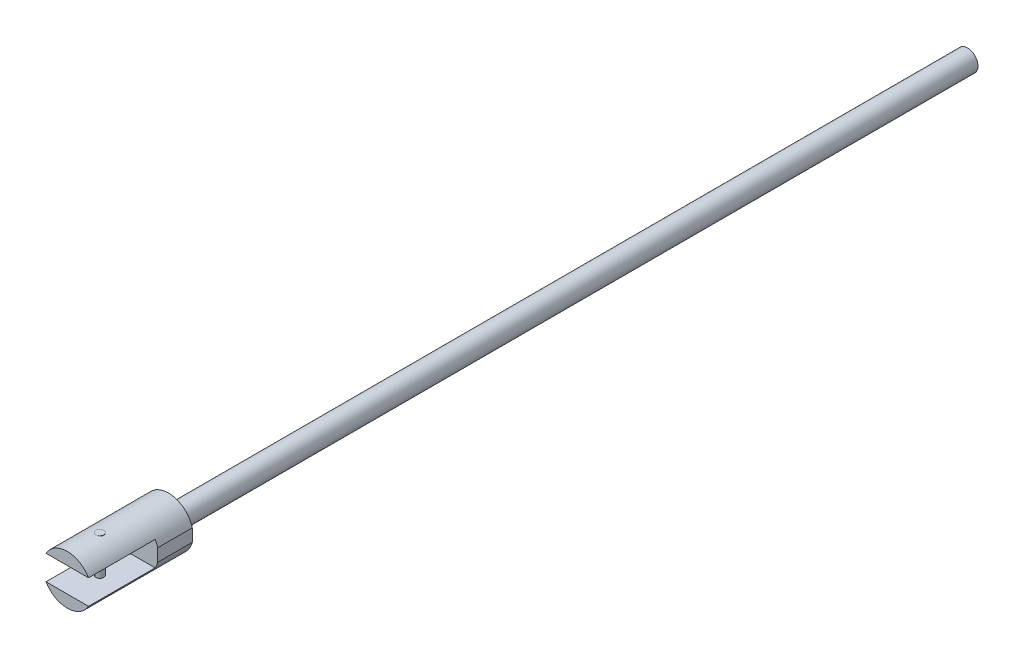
ISO-10303-21;
HEADER;
FILE_DESCRIPTION(('STEP AP214'),'2;1');
FILE_NAME('part.step','',(''),(''),'','','');
FILE_SCHEMA(('AUTOMOTIVE_DESIGN { 1 0 10303 214 1 1 1 1 }'));
ENDSEC;
DATA;
#1=APPLICATION_CONTEXT('core data for automotive mechanical design processes');
#2=APPLICATION_PROTOCOL_DEFINITION('international standard','automotive_design',2000,#1);
#3=PRODUCT_CONTEXT('',#1,'mechanical');
#4=PRODUCT('Part','Part','',(#3));
#5=PRODUCT_RELATED_PRODUCT_CATEGORY('part','',(#4));
#6=PRODUCT_DEFINITION_FORMATION('','',#4);
#7=PRODUCT_DEFINITION_CONTEXT('part definition',#1,'design');
#8=PRODUCT_DEFINITION('design','',#6,#7);
#9=PRODUCT_DEFINITION_SHAPE('','',#8);
#10=(LENGTH_UNIT() NAMED_UNIT(*) SI_UNIT(.MILLI.,.METRE.));
#11=(NAMED_UNIT(*) PLANE_ANGLE_UNIT() SI_UNIT($,.RADIAN.));
#12=(NAMED_UNIT(*) SI_UNIT($,.STERADIAN.) SOLID_ANGLE_UNIT());
#13=UNCERTAINTY_MEASURE_WITH_UNIT(LENGTH_MEASURE(1.E-05),#10,'distance_accuracy_value','');
#14=(GEOMETRIC_REPRESENTATION_CONTEXT(3) GLOBAL_UNCERTAINTY_ASSIGNED_CONTEXT((#13)) GLOBAL_UNIT_ASSIGNED_CONTEXT((#10,
#11,#12)) REPRESENTATION_CONTEXT('',''));
#15=CARTESIAN_POINT('',(0.,0.,0.));
#16=DIRECTION('',(0.,0.,1.));
#17=DIRECTION('',(1.,0.,0.));
#18=AXIS2_PLACEMENT_3D('',#15,#16,#17);
#19=CARTESIAN_POINT('',(-4.53418049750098,-4.68995455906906,159.004));
#20=DIRECTION('',(1.,0.,0.));
#21=DIRECTION('',(0.,0.,-1.));
#22=AXIS2_PLACEMENT_3D('',#19,#20,#21);
#23=PLANE('',#22);
#24=DIRECTION('',(0.,0.,1.));
#25=VECTOR('',#24,1.);
#26=CARTESIAN_POINT('',(-4.53418049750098,1.19869970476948,0.));
#27=LINE('',#26,#25);
#28=CARTESIAN_POINT('',(-4.53418049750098,1.19869970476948,152.4));
#29=VERTEX_POINT('',#28);
#30=CARTESIAN_POINT('',(-4.53418049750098,1.19869970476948,159.004));
#31=VERTEX_POINT('',#30);
#32=EDGE_CURVE('E154',#29,#31,#27,.T.);
#33=ORIENTED_EDGE('',*,*,#32,.F.);
#34=DIRECTION('',(0.,-1.,0.));
#35=VECTOR('',#34,1.);
#36=CARTESIAN_POINT('',(-4.53418049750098,-4.68995455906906,152.4));
#37=LINE('',#36,#35);
#38=CARTESIAN_POINT('',(-4.53418049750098,-1.19869970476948,152.4));
#39=VERTEX_POINT('',#38);
#40=EDGE_CURVE('E166',#29,#39,#37,.T.);
#41=ORIENTED_EDGE('',*,*,#40,.T.);
#42=DIRECTION('',(0.,0.,1.));
#43=VECTOR('',#42,1.);
#44=CARTESIAN_POINT('',(-4.53418049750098,-1.19869970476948,0.));
#45=LINE('',#44,#43);
#46=CARTESIAN_POINT('',(-4.53418049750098,-1.19869970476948,159.004));
#47=VERTEX_POINT('',#46);
#48=EDGE_CURVE('E144',#47,#39,#45,.F.);
#49=ORIENTED_EDGE('',*,*,#48,.F.);
#50=DIRECTION('',(0.,-1.,0.));
#51=VECTOR('',#50,1.);
#52=CARTESIAN_POINT('',(-4.53418049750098,-4.68995455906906,159.004));
#53=LINE('',#52,#51);
#54=EDGE_CURVE('E179',#31,#47,#53,.T.);
#55=ORIENTED_EDGE('',*,*,#54,.F.);
#56=EDGE_LOOP('',(#33,#41,#49,#55));
#57=FACE_BOUND('',#56,.T.);
#58=ADVANCED_FACE('F36',(#57),#23,.F.);
#59=CARTESIAN_POINT('',(4.53418049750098,-4.68995455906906,159.004));
#60=DIRECTION('',(-1.,0.,0.));
#61=DIRECTION('',(0.,0.,1.));
#62=AXIS2_PLACEMENT_3D('',#59,#60,#61);
#63=PLANE('',#62);
#64=DIRECTION('',(0.,0.,1.));
#65=VECTOR('',#64,1.);
#66=CARTESIAN_POINT('',(4.53418049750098,-1.19869970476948,0.));
#67=LINE('',#66,#65);
#68=CARTESIAN_POINT('',(4.53418049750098,-1.19869970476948,152.4));
#69=VERTEX_POINT('',#68);
#70=CARTESIAN_POINT('',(4.53418049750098,-1.19869970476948,159.004));
#71=VERTEX_POINT('',#70);
#72=EDGE_CURVE('E136',#69,#71,#67,.T.);
#73=ORIENTED_EDGE('',*,*,#72,.F.);
#74=DIRECTION('',(0.,1.,0.));
#75=VECTOR('',#74,1.);
#76=CARTESIAN_POINT('',(4.53418049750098,-4.68995455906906,152.4));
#77=LINE('',#76,#75);
#78=CARTESIAN_POINT('',(4.53418049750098,1.19869970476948,152.4));
#79=VERTEX_POINT('',#78);
#80=EDGE_CURVE('E184',#69,#79,#77,.T.);
#81=ORIENTED_EDGE('',*,*,#80,.T.);
#82=DIRECTION('',(0.,0.,1.));
#83=VECTOR('',#82,1.);
#84=CARTESIAN_POINT('',(4.53418049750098,1.19869970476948,0.));
#85=LINE('',#84,#83);
#86=CARTESIAN_POINT('',(4.53418049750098,1.19869970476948,159.004));
#87=VERTEX_POINT('',#86);
#88=EDGE_CURVE('E143',#87,#79,#85,.F.);
#89=ORIENTED_EDGE('',*,*,#88,.F.);
#90=DIRECTION('',(0.,1.,0.));
#91=VECTOR('',#90,1.);
#92=CARTESIAN_POINT('',(4.53418049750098,-4.68995455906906,159.004));
#93=LINE('',#92,#91);
#94=EDGE_CURVE('E176',#71,#87,#93,.T.);
#95=ORIENTED_EDGE('',*,*,#94,.F.);
#96=EDGE_LOOP('',(#73,#81,#89,#95));
#97=FACE_BOUND('',#96,.T.);
#98=ADVANCED_FACE('F205',(#97),#63,.F.);
#99=CARTESIAN_POINT('',(0.,0.,159.004));
#100=DIRECTION('',(0.,0.,1.));
#101=DIRECTION('',(1.,0.,0.));
#102=AXIS2_PLACEMENT_3D('',#99,#100,#101);
#103=PLANE('',#102);
#104=ORIENTED_EDGE('',*,*,#94,.T.);
#105=CARTESIAN_POINT('',(0.,0.,159.004));
#106=DIRECTION('',(0.,0.,1.));
#107=DIRECTION('',(1.,0.,0.));
#108=AXIS2_PLACEMENT_3D('',#105,#106,#107);
#109=CIRCLE('',#108,4.68995455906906);
#110=CARTESIAN_POINT('',(4.05807772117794,2.35110165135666,159.004));
#111=VERTEX_POINT('',#110);
#112=EDGE_CURVE('E151',#87,#111,#109,.T.);
#113=ORIENTED_EDGE('',*,*,#112,.T.);
#114=DIRECTION('',(1.,0.,0.));
#115=VECTOR('',#114,1.);
#116=CARTESIAN_POINT('',(-4.53418049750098,2.35110165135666,159.004));
#117=LINE('',#116,#115);
#118=CARTESIAN_POINT('',(-4.05807772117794,2.35110165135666,159.004));
#119=VERTEX_POINT('',#118);
#120=EDGE_CURVE('E160',#119,#111,#117,.T.);
#121=ORIENTED_EDGE('',*,*,#120,.F.);
#122=EDGE_CURVE('E137',#119,#31,#109,.T.);
#123=ORIENTED_EDGE('',*,*,#122,.T.);
#124=ORIENTED_EDGE('',*,*,#54,.T.);
#125=CARTESIAN_POINT('',(-4.05807772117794,-2.35110165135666,159.004));
#126=VERTEX_POINT('',#125);
#127=EDGE_CURVE('E138',#47,#126,#109,.T.);
#128=ORIENTED_EDGE('',*,*,#127,.T.);
#129=DIRECTION('',(1.,0.,0.));
#130=VECTOR('',#129,1.);
#131=CARTESIAN_POINT('',(-4.53418049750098,-2.35110165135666,159.004));
#132=LINE('',#131,#130);
#133=CARTESIAN_POINT('',(4.05807772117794,-2.35110165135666,159.004));
#134=VERTEX_POINT('',#133);
#135=EDGE_CURVE('E156',#126,#134,#132,.T.);
#136=ORIENTED_EDGE('',*,*,#135,.T.);
#137=EDGE_CURVE('E133',#134,#71,#109,.T.);
#138=ORIENTED_EDGE('',*,*,#137,.T.);
#139=EDGE_LOOP('',(#104,#113,#121,#123,#124,#128,#136,#138));
#140=FACE_BOUND('',#139,.T.);
#141=ADVANCED_FACE('F210',(#140),#103,.T.);
#142=CARTESIAN_POINT('',(0.,0.,152.4));
#143=DIRECTION('',(0.,0.,1.));
#144=DIRECTION('',(1.,0.,0.));
#145=AXIS2_PLACEMENT_3D('',#142,#143,#144);
#146=PLANE('',#145);
#147=CARTESIAN_POINT('',(0.,0.,152.4));
#148=DIRECTION('',(0.,0.,1.));
#149=DIRECTION('',(1.,0.,0.));
#150=AXIS2_PLACEMENT_3D('',#147,#148,#149);
#151=CIRCLE('',#150,2.);
#152=CARTESIAN_POINT('',(-2.,0.,152.4));
#153=VERTEX_POINT('',#152);
#154=EDGE_CURVE('E187',#153,#153,#151,.T.);
#155=ORIENTED_EDGE('',*,*,#154,.T.);
#156=EDGE_LOOP('',(#155));
#157=FACE_BOUND('',#156,.T.);
#158=CARTESIAN_POINT('',(0.,0.,152.4));
#159=DIRECTION('',(0.,0.,1.));
#160=DIRECTION('',(1.,0.,0.));
#161=AXIS2_PLACEMENT_3D('',#158,#159,#160);
#162=CIRCLE('',#161,4.68995455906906);
#163=EDGE_CURVE('E141',#79,#29,#162,.T.);
#164=ORIENTED_EDGE('',*,*,#163,.F.);
#165=ORIENTED_EDGE('',*,*,#80,.F.);
#166=EDGE_CURVE('E140',#39,#69,#162,.T.);
#167=ORIENTED_EDGE('',*,*,#166,.F.);
#168=ORIENTED_EDGE('',*,*,#40,.F.);
#169=EDGE_LOOP('',(#164,#165,#167,#168));
#170=FACE_BOUND('',#169,.T.);
#171=ADVANCED_FACE('F215',(#157,#170),#146,.F.);
#172=CARTESIAN_POINT('',(-4.53418049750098,2.35110165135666,171.704));
#173=DIRECTION('',(0.,1.,0.));
#174=DIRECTION('',(0.,0.,1.));
#175=AXIS2_PLACEMENT_3D('',#172,#173,#174);
#176=PLANE('',#175);
#177=CARTESIAN_POINT('',(0.,2.35110165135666,165.48700250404));
#178=DIRECTION('',(0.,1.,0.));
#179=DIRECTION('',(0.,0.,1.));
#180=AXIS2_PLACEMENT_3D('',#177,#178,#179);
#181=CIRCLE('',#180,0.75);
#182=CARTESIAN_POINT('',(0.,2.35110165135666,166.23700250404));
#183=VERTEX_POINT('',#182);
#184=EDGE_CURVE('E124',#183,#183,#181,.T.);
#185=ORIENTED_EDGE('',*,*,#184,.T.);
#186=EDGE_LOOP('',(#185));
#187=FACE_BOUND('',#186,.T.);
#188=DIRECTION('',(0.,0.,1.));
#189=VECTOR('',#188,1.);
#190=CARTESIAN_POINT('',(-4.05807772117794,2.35110165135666,0.));
#191=LINE('',#190,#189);
#192=CARTESIAN_POINT('',(-4.05807772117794,2.35110165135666,171.704));
#193=VERTEX_POINT('',#192);
#194=EDGE_CURVE('E63',#119,#193,#191,.T.);
#195=ORIENTED_EDGE('',*,*,#194,.F.);
#196=ORIENTED_EDGE('',*,*,#120,.T.);
#197=DIRECTION('',(0.,0.,1.));
#198=VECTOR('',#197,1.);
#199=CARTESIAN_POINT('',(4.05807772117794,2.35110165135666,0.));
#200=LINE('',#199,#198);
#201=CARTESIAN_POINT('',(4.05807772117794,2.35110165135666,171.704));
#202=VERTEX_POINT('',#201);
#203=EDGE_CURVE('E149',#202,#111,#200,.F.);
#204=ORIENTED_EDGE('',*,*,#203,.F.);
#205=DIRECTION('',(1.,0.,0.));
#206=VECTOR('',#205,1.);
#207=CARTESIAN_POINT('',(-4.53418049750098,2.35110165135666,171.704));
#208=LINE('',#207,#206);
#209=EDGE_CURVE('E163',#193,#202,#208,.T.);
#210=ORIENTED_EDGE('',*,*,#209,.F.);
#211=EDGE_LOOP('',(#195,#196,#204,#210));
#212=FACE_BOUND('',#211,.T.);
#213=ADVANCED_FACE('F218',(#187,#212),#176,.F.);
#214=CARTESIAN_POINT('',(0.,0.,171.704));
#215=DIRECTION('',(0.,0.,1.));
#216=DIRECTION('',(1.,0.,0.));
#217=AXIS2_PLACEMENT_3D('',#214,#215,#216);
#218=PLANE('',#217);
#219=ORIENTED_EDGE('',*,*,#209,.T.);
#220=CARTESIAN_POINT('',(0.,0.,171.704));
#221=DIRECTION('',(0.,0.,1.));
#222=DIRECTION('',(1.,0.,0.));
#223=AXIS2_PLACEMENT_3D('',#220,#221,#222);
#224=CIRCLE('',#223,4.68995455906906);
#225=EDGE_CURVE('E126',#202,#193,#224,.T.);
#226=ORIENTED_EDGE('',*,*,#225,.T.);
#227=EDGE_LOOP('',(#219,#226));
#228=FACE_BOUND('',#227,.T.);
#229=ADVANCED_FACE('F225',(#228),#218,.T.);
#230=CARTESIAN_POINT('',(-4.53418049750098,-2.35110165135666,171.704));
#231=DIRECTION('',(0.,1.,0.));
#232=DIRECTION('',(0.,0.,1.));
#233=AXIS2_PLACEMENT_3D('',#230,#231,#232);
#234=PLANE('',#233);
#235=CARTESIAN_POINT('',(0.,-2.35110165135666,165.48700250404));
#236=DIRECTION('',(0.,1.,0.));
#237=DIRECTION('',(0.,0.,1.));
#238=AXIS2_PLACEMENT_3D('',#235,#236,#237);
#239=CIRCLE('',#238,0.75);
#240=CARTESIAN_POINT('',(0.,-2.35110165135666,166.23700250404));
#241=VERTEX_POINT('',#240);
#242=EDGE_CURVE('E12',#241,#241,#239,.T.);
#243=ORIENTED_EDGE('',*,*,#242,.F.);
#244=EDGE_LOOP('',(#243));
#245=FACE_BOUND('',#244,.T.);
#246=ORIENTED_EDGE('',*,*,#135,.F.);
#247=DIRECTION('',(0.,0.,1.));
#248=VECTOR('',#247,1.);
#249=CARTESIAN_POINT('',(-4.05807772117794,-2.35110165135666,0.));
#250=LINE('',#249,#248);
#251=CARTESIAN_POINT('',(-4.05807772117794,-2.35110165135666,171.704));
#252=VERTEX_POINT('',#251);
#253=EDGE_CURVE('E146',#126,#252,#250,.T.);
#254=ORIENTED_EDGE('',*,*,#253,.T.);
#255=DIRECTION('',(1.,0.,0.));
#256=VECTOR('',#255,1.);
#257=CARTESIAN_POINT('',(-4.53418049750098,-2.35110165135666,171.704));
#258=LINE('',#257,#256);
#259=CARTESIAN_POINT('',(4.05807772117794,-2.35110165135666,171.704));
#260=VERTEX_POINT('',#259);
#261=EDGE_CURVE('E157',#252,#260,#258,.T.);
#262=ORIENTED_EDGE('',*,*,#261,.T.);
#263=DIRECTION('',(0.,0.,1.));
#264=VECTOR('',#263,1.);
#265=CARTESIAN_POINT('',(4.05807772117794,-2.35110165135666,0.));
#266=LINE('',#265,#264);
#267=EDGE_CURVE('E130',#260,#134,#266,.F.);
#268=ORIENTED_EDGE('',*,*,#267,.T.);
#269=EDGE_LOOP('',(#246,#254,#262,#268));
#270=FACE_BOUND('',#269,.T.);
#271=ADVANCED_FACE('F229',(#245,#270),#234,.T.);
#272=CARTESIAN_POINT('',(0.,0.,171.704));
#273=DIRECTION('',(0.,0.,1.));
#274=DIRECTION('',(1.,0.,0.));
#275=AXIS2_PLACEMENT_3D('',#272,#273,#274);
#276=PLANE('',#275);
#277=ORIENTED_EDGE('',*,*,#261,.F.);
#278=CARTESIAN_POINT('',(0.,0.,171.704));
#279=DIRECTION('',(0.,0.,1.));
#280=DIRECTION('',(1.,0.,0.));
#281=AXIS2_PLACEMENT_3D('',#278,#279,#280);
#282=CIRCLE('',#281,4.68995455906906);
#283=EDGE_CURVE('E118',#252,#260,#282,.T.);
#284=ORIENTED_EDGE('',*,*,#283,.T.);
#285=EDGE_LOOP('',(#277,#284));
#286=FACE_BOUND('',#285,.T.);
#287=ADVANCED_FACE('F201',(#286),#276,.T.);
#288=CARTESIAN_POINT('',(0.,0.,152.4));
#289=DIRECTION('',(0.,0.,-1.));
#290=DIRECTION('',(-1.,0.,0.));
#291=AXIS2_PLACEMENT_3D('',#288,#289,#290);
#292=CYLINDRICAL_SURFACE('',#291,2.);
#293=CARTESIAN_POINT('',(0.,0.,0.));
#294=DIRECTION('',(0.,0.,1.));
#295=DIRECTION('',(1.,0.,0.));
#296=AXIS2_PLACEMENT_3D('',#293,#294,#295);
#297=CIRCLE('',#296,2.);
#298=CARTESIAN_POINT('',(-2.,0.,0.));
#299=VERTEX_POINT('',#298);
#300=EDGE_CURVE('E178',#299,#299,#297,.T.);
#301=CARTESIAN_POINT('',(-2.,0.,152.4));
#302=CARTESIAN_POINT('',(-2.,0.,150.8125));
#303=CARTESIAN_POINT('',(-2.,0.,149.225));
#304=CARTESIAN_POINT('',(-2.,0.,146.05));
#305=CARTESIAN_POINT('',(-2.,0.,144.4625));
#306=CARTESIAN_POINT('',(-2.,0.,141.2875));
#307=CARTESIAN_POINT('',(-2.,0.,139.7));
#308=CARTESIAN_POINT('',(-2.,0.,136.525));
#309=CARTESIAN_POINT('',(-2.,0.,134.9375));
#310=CARTESIAN_POINT('',(-2.,0.,131.7625));
#311=CARTESIAN_POINT('',(-2.,0.,130.175));
#312=CARTESIAN_POINT('',(-2.,0.,127.));
#313=CARTESIAN_POINT('',(-2.,0.,125.4125));
#314=CARTESIAN_POINT('',(-2.,0.,122.2375));
#315=CARTESIAN_POINT('',(-2.,0.,120.65));
#316=CARTESIAN_POINT('',(-2.,0.,117.475));
#317=CARTESIAN_POINT('',(-2.,0.,115.8875));
#318=CARTESIAN_POINT('',(-2.,0.,112.7125));
#319=CARTESIAN_POINT('',(-2.,0.,111.125));
#320=CARTESIAN_POINT('',(-2.,0.,107.95));
#321=CARTESIAN_POINT('',(-2.,0.,106.3625));
#322=CARTESIAN_POINT('',(-2.,0.,103.1875));
#323=CARTESIAN_POINT('',(-2.,0.,101.6));
#324=CARTESIAN_POINT('',(-2.,0.,98.425));
#325=CARTESIAN_POINT('',(-2.,0.,96.8375));
#326=CARTESIAN_POINT('',(-2.,0.,93.6625));
#327=CARTESIAN_POINT('',(-2.,0.,92.075));
#328=CARTESIAN_POINT('',(-2.,0.,88.9));
#329=CARTESIAN_POINT('',(-2.,0.,87.3125));
#330=CARTESIAN_POINT('',(-2.,0.,84.1375));
#331=CARTESIAN_POINT('',(-2.,0.,82.55));
#332=CARTESIAN_POINT('',(-2.,0.,79.375));
#333=CARTESIAN_POINT('',(-2.,0.,77.7875));
#334=CARTESIAN_POINT('',(-2.,0.,74.6125));
#335=CARTESIAN_POINT('',(-2.,0.,73.025));
#336=CARTESIAN_POINT('',(-2.,0.,69.85));
#337=CARTESIAN_POINT('',(-2.,0.,68.2625));
#338=CARTESIAN_POINT('',(-2.,0.,65.0875));
#339=CARTESIAN_POINT('',(-2.,0.,63.5));
#340=CARTESIAN_POINT('',(-2.,0.,60.325));
#341=CARTESIAN_POINT('',(-2.,0.,58.7375));
#342=CARTESIAN_POINT('',(-2.,0.,55.5625));
#343=CARTESIAN_POINT('',(-2.,0.,53.975));
#344=CARTESIAN_POINT('',(-2.,0.,50.8));
#345=CARTESIAN_POINT('',(-2.,0.,49.2125));
#346=CARTESIAN_POINT('',(-2.,0.,46.0375));
#347=CARTESIAN_POINT('',(-2.,0.,44.45));
#348=CARTESIAN_POINT('',(-2.,0.,41.275));
#349=CARTESIAN_POINT('',(-2.,0.,39.6875));
#350=CARTESIAN_POINT('',(-2.,0.,36.5125));
#351=CARTESIAN_POINT('',(-2.,0.,34.925));
#352=CARTESIAN_POINT('',(-2.,0.,31.75));
#353=CARTESIAN_POINT('',(-2.,0.,30.1625));
#354=CARTESIAN_POINT('',(-2.,0.,26.9875));
#355=CARTESIAN_POINT('',(-2.,0.,25.4));
#356=CARTESIAN_POINT('',(-2.,0.,22.225));
#357=CARTESIAN_POINT('',(-2.,0.,20.6375));
#358=CARTESIAN_POINT('',(-2.,0.,17.4625));
#359=CARTESIAN_POINT('',(-2.,0.,15.875));
#360=CARTESIAN_POINT('',(-2.,0.,12.7));
#361=CARTESIAN_POINT('',(-2.,0.,11.1125));
#362=CARTESIAN_POINT('',(-2.,0.,7.93750000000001));
#363=CARTESIAN_POINT('',(-2.,0.,6.35));
#364=CARTESIAN_POINT('',(-2.,0.,3.175));
#365=CARTESIAN_POINT('',(-2.,0.,1.5875));
#366=CARTESIAN_POINT('',(-2.,0.,0.));
#367=B_SPLINE_CURVE_WITH_KNOTS('',3,(#301,#302,#303,#304,#305,#306,#307,#308,#309,#310,#311,
#312,#313,#314,#315,#316,#317,#318,#319,#320,#321,#322,#323,#324,#325,#326,#327,#328,#329,#330,
#331,#332,#333,#334,#335,#336,#337,#338,#339,#340,#341,#342,#343,#344,#345,#346,#347,#348,#349,
#350,#351,#352,#353,#354,#355,#356,#357,#358,#359,#360,#361,#362,#363,#364,#365,#366),
.UNSPECIFIED.,.F.,.F.,(4,2,2,2,2,2,2,2,2,2,2,2,2,2,2,2,2,2,2,2,2,2,2,2,2,2,2,2,2,2,2,2,4),(0.,
4.7625,9.52500000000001,14.2875,19.05,23.8125,28.575,33.3375,38.1,42.8625,47.625,52.3875,57.15,
61.9125,66.675,71.4375,76.2,80.9625,85.725,90.4875,95.25,100.0125,104.775,109.5375,114.3,
119.0625,123.825,128.5875,133.35,138.1125,142.875,147.6375,152.4),.UNSPECIFIED.);
#368=EDGE_CURVE('BSEAM38',#153,#299,#367,.T.);
#369=ORIENTED_EDGE('',*,*,#154,.F.);
#370=ORIENTED_EDGE('',*,*,#300,.T.);
#371=ORIENTED_EDGE('',*,*,#368,.T.);
#372=ORIENTED_EDGE('',*,*,#368,.F.);
#373=EDGE_LOOP('',(#369,#371,#370,#372));
#374=FACE_BOUND('',#373,.T.);
#375=ADVANCED_FACE('F38',(#374),#292,.T.);
#376=CARTESIAN_POINT('',(0.,0.,0.));
#377=DIRECTION('',(0.,0.,1.));
#378=DIRECTION('',(1.,0.,0.));
#379=AXIS2_PLACEMENT_3D('',#376,#377,#378);
#380=PLANE('',#379);
#381=ORIENTED_EDGE('',*,*,#300,.F.);
#382=EDGE_LOOP('',(#381));
#383=FACE_BOUND('',#382,.T.);
#384=ADVANCED_FACE('F193',(#383),#380,.F.);
#385=CARTESIAN_POINT('',(0.,0.,0.));
#386=DIRECTION('',(0.,0.,1.));
#387=DIRECTION('',(1.,0.,0.));
#388=AXIS2_PLACEMENT_3D('',#385,#386,#387);
#389=CYLINDRICAL_SURFACE('',#388,4.68995455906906);
#390=ORIENTED_EDGE('',*,*,#166,.T.);
#391=ORIENTED_EDGE('',*,*,#72,.T.);
#392=ORIENTED_EDGE('',*,*,#137,.F.);
#393=ORIENTED_EDGE('',*,*,#267,.F.);
#394=ORIENTED_EDGE('',*,*,#283,.F.);
#395=ORIENTED_EDGE('',*,*,#253,.F.);
#396=ORIENTED_EDGE('',*,*,#127,.F.);
#397=ORIENTED_EDGE('',*,*,#48,.T.);
#398=EDGE_LOOP('',(#390,#391,#392,#393,#394,#395,#396,#397));
#399=FACE_BOUND('',#398,.T.);
#400=ADVANCED_FACE('F195',(#399),#389,.T.);
#401=CARTESIAN_POINT('',(0.,4.68995455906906,166.23700250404));
#402=CARTESIAN_POINT('',(0.0418416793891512,4.68995385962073,166.237000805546));
#403=CARTESIAN_POINT('',(0.0837067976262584,4.68938877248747,166.233489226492));
#404=CARTESIAN_POINT('',(0.166264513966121,4.68718893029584,166.2195405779));
#405=CARTESIAN_POINT('',(0.206955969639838,4.68555316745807,166.209096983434));
#406=CARTESIAN_POINT('',(0.28595983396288,4.68139559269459,166.181606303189));
#407=CARTESIAN_POINT('',(0.324274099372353,4.67887448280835,166.164564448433));
#408=CARTESIAN_POINT('',(0.397493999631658,4.67322399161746,166.124374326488));
#409=CARTESIAN_POINT('',(0.432400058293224,4.67009468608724,166.101226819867));
#410=CARTESIAN_POINT('',(0.498126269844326,4.6635442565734,166.049264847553));
#411=CARTESIAN_POINT('',(0.528911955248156,4.66012102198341,166.020407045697));
#412=CARTESIAN_POINT('',(0.585225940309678,4.65338486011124,165.957936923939));
#413=CARTESIAN_POINT('',(0.610753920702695,4.65007193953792,165.92432431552));
#414=CARTESIAN_POINT('',(0.655964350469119,4.64391105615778,165.853064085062));
#415=CARTESIAN_POINT('',(0.675613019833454,4.64106582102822,165.81539477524));
#416=CARTESIAN_POINT('',(0.708291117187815,4.63619155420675,165.737237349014));
#417=CARTESIAN_POINT('',(0.721320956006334,4.63416247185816,165.696749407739));
#418=CARTESIAN_POINT('',(0.740283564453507,4.63117115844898,165.614468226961));
#419=CARTESIAN_POINT('',(0.746275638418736,4.6302000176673,165.572688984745));
#420=CARTESIAN_POINT('',(0.75117643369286,4.62940755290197,165.488707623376));
#421=CARTESIAN_POINT('',(0.75008561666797,4.62958615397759,165.446505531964));
#422=CARTESIAN_POINT('',(0.740899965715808,4.63106485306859,165.363297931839));
#423=CARTESIAN_POINT('',(0.732871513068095,4.6323543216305,165.322284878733));
#424=CARTESIAN_POINT('',(0.710142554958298,4.63589284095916,165.242195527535));
#425=CARTESIAN_POINT('',(0.695441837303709,4.63814192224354,165.203119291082));
#426=CARTESIAN_POINT('',(0.659717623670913,4.64335784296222,165.127812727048));
#427=CARTESIAN_POINT('',(0.638666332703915,4.64632782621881,165.091595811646));
#428=CARTESIAN_POINT('',(0.590858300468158,4.65264868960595,165.023183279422));
#429=CARTESIAN_POINT('',(0.564101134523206,4.65599959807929,164.990987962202));
#430=CARTESIAN_POINT('',(0.505278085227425,4.66275156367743,164.931148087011));
#431=CARTESIAN_POINT('',(0.473155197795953,4.66615275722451,164.903559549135));
#432=CARTESIAN_POINT('',(0.404705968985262,4.67258671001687,164.854156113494));
#433=CARTESIAN_POINT('',(0.368379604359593,4.67561946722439,164.832341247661));
#434=CARTESIAN_POINT('',(0.292503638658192,4.68097865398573,164.795100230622));
#435=CARTESIAN_POINT('',(0.252951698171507,4.68330456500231,164.779678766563));
#436=CARTESIAN_POINT('',(0.171773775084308,4.68698376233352,164.75571292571));
#437=CARTESIAN_POINT('',(0.130147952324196,4.68833712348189,164.747168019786));
#438=CARTESIAN_POINT('',(0.0464869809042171,4.68990873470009,164.737273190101));
#439=CARTESIAN_POINT('',(0.00446115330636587,4.69013912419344,164.735846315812));
#440=CARTESIAN_POINT('',(-0.079229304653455,4.68947199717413,164.740023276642));
#441=CARTESIAN_POINT('',(-0.120893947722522,4.68857452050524,164.745626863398));
#442=CARTESIAN_POINT('',(-0.202443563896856,4.68576001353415,164.763641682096));
#443=CARTESIAN_POINT('',(-0.242337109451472,4.68384865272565,164.776015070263));
#444=CARTESIAN_POINT('',(-0.319483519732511,4.67921989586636,164.807178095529));
#445=CARTESIAN_POINT('',(-0.356736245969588,4.6765024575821,164.825968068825));
#446=CARTESIAN_POINT('',(-0.42787952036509,4.67053307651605,164.869608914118));
#447=CARTESIAN_POINT('',(-0.461740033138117,4.6672769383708,164.894508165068));
#448=CARTESIAN_POINT('',(-0.524829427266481,4.66060469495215,164.949593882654));
#449=CARTESIAN_POINT('',(-0.554058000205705,4.65718857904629,164.979780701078));
#450=CARTESIAN_POINT('',(-0.607336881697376,4.6505424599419,165.044928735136));
#451=CARTESIAN_POINT('',(-0.631335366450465,4.64731453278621,165.07993257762));
#452=CARTESIAN_POINT('',(-0.673111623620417,4.64144820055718,165.153519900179));
#453=CARTESIAN_POINT('',(-0.690889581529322,4.63880977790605,165.19210327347));
#454=CARTESIAN_POINT('',(-0.719641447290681,4.63443654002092,165.271605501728));
#455=CARTESIAN_POINT('',(-0.730641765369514,4.63269822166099,165.312514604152));
#456=CARTESIAN_POINT('',(-0.745609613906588,4.6303130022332,165.395629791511));
#457=CARTESIAN_POINT('',(-0.749577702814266,4.62966601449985,165.437835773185));
#458=CARTESIAN_POINT('',(-0.75035383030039,4.62954024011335,165.521829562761));
#459=CARTESIAN_POINT('',(-0.747243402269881,4.6300481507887,165.563616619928));
#460=CARTESIAN_POINT('',(-0.73412643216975,4.63214589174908,165.64606489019));
#461=CARTESIAN_POINT('',(-0.724119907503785,4.63373571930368,165.686726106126));
#462=CARTESIAN_POINT('',(-0.697525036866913,4.63781327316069,165.765740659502));
#463=CARTESIAN_POINT('',(-0.680943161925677,4.64030011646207,165.804096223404));
#464=CARTESIAN_POINT('',(-0.641676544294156,4.64589243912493,165.877494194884));
#465=CARTESIAN_POINT('',(-0.618991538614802,4.6489979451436,165.912536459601));
#466=CARTESIAN_POINT('',(-0.567869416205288,4.65552010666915,165.978726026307));
#467=CARTESIAN_POINT('',(-0.539372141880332,4.65893979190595,166.009826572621));
#468=CARTESIAN_POINT('',(-0.477561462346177,4.66568036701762,166.066832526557));
#469=CARTESIAN_POINT('',(-0.444246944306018,4.66900123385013,166.092736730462));
#470=CARTESIAN_POINT('',(-0.373498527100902,4.67519415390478,166.138762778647));
#471=CARTESIAN_POINT('',(-0.336039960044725,4.6780632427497,166.158847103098));
#472=CARTESIAN_POINT('',(-0.258251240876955,4.68300042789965,166.192408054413));
#473=CARTESIAN_POINT('',(-0.21792404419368,4.68506933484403,166.205891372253));
#474=CARTESIAN_POINT('',(-0.147858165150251,4.68771285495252,166.222885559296));
#475=CARTESIAN_POINT('',(-0.118547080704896,4.68854907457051,166.228171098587));
#476=CARTESIAN_POINT('',(-0.0594946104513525,4.68967017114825,166.235230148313));
#477=CARTESIAN_POINT('',(-0.0297532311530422,4.6899550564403,166.237003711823));
#478=CARTESIAN_POINT('',(0.,4.68995455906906,166.23700250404));
#479=B_SPLINE_CURVE_WITH_KNOTS('',3,(#401,#402,#403,#404,#405,#406,#407,#408,#409,#410,#411,
#412,#413,#414,#415,#416,#417,#418,#419,#420,#421,#422,#423,#424,#425,#426,#427,#428,#429,#430,
#431,#432,#433,#434,#435,#436,#437,#438,#439,#440,#441,#442,#443,#444,#445,#446,#447,#448,#449,
#450,#451,#452,#453,#454,#455,#456,#457,#458,#459,#460,#461,#462,#463,#464,#465,#466,#467,#468,
#469,#470,#471,#472,#473,#474,#475,#476,#477,#478),.UNSPECIFIED.,.T.,.F.,(4,2,2,2,2,2,2,2,2,2,2,
2,2,2,2,2,2,2,2,2,2,2,2,2,2,2,2,2,2,2,2,2,2,2,2,2,2,2,4),(0.,0.125416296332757,0.25095081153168,
0.376386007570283,0.501805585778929,0.628216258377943,0.754634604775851,0.881765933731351,
1.00888937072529,1.13493372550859,1.26096986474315,1.38581324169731,1.51066058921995,
1.63606249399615,1.76147373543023,1.88831365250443,2.01515427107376,2.14208771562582,
2.26901139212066,2.3945599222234,2.52010401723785,2.64495337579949,2.76980927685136,
2.89568775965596,3.02157462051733,3.14865723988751,3.27573606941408,3.40231653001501,
3.52888693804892,3.65400684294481,3.77912643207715,3.9041231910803,4.02912533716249,
4.1554936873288,4.28189127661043,4.40908647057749,4.53615246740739,4.62533618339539,
4.71451855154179),.UNSPECIFIED.);
#480=CARTESIAN_POINT('',(0.,4.68995455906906,166.23700250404));
#481=VERTEX_POINT('',#480);
#482=CARTESIAN_POINT('',(1.55795797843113E-12,4.68995455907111,164.737002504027));
#483=VERTEX_POINT('',#482);
#484=EDGE_CURVE('E49',#481,#483,#479,.T.);
#485=ORIENTED_EDGE('',*,*,#484,.F.);
#486=EDGE_CURVE('E40',#483,#481,#479,.T.);
#487=ORIENTED_EDGE('',*,*,#486,.F.);
#488=EDGE_LOOP('',(#485,#487));
#489=FACE_BOUND('',#488,.T.);
#490=ORIENTED_EDGE('',*,*,#163,.T.);
#491=ORIENTED_EDGE('',*,*,#32,.T.);
#492=ORIENTED_EDGE('',*,*,#122,.F.);
#493=ORIENTED_EDGE('',*,*,#194,.T.);
#494=ORIENTED_EDGE('',*,*,#225,.F.);
#495=ORIENTED_EDGE('',*,*,#203,.T.);
#496=ORIENTED_EDGE('',*,*,#112,.F.);
#497=ORIENTED_EDGE('',*,*,#88,.T.);
#498=EDGE_LOOP('',(#490,#491,#492,#493,#494,#495,#496,#497));
#499=FACE_BOUND('',#498,.T.);
#500=ADVANCED_FACE('F109',(#489,#499),#389,.T.);
#501=CARTESIAN_POINT('',(0.,-4.69095455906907,165.48700250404));
#502=DIRECTION('',(0.,1.,0.));
#503=DIRECTION('',(0.,0.,1.));
#504=AXIS2_PLACEMENT_3D('',#501,#502,#503);
#505=CYLINDRICAL_SURFACE('',#504,0.75);
#506=CARTESIAN_POINT('',(0.,4.68995455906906,165.48700250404));
#507=DIRECTION('',(0.,1.,0.));
#508=DIRECTION('',(0.,0.,1.));
#509=AXIS2_PLACEMENT_3D('',#506,#507,#508);
#510=CIRCLE('',#509,0.75);
#511=EDGE_CURVE('E116',#483,#481,#510,.T.);
#512=ORIENTED_EDGE('',*,*,#511,.F.);
#513=ORIENTED_EDGE('',*,*,#486,.T.);
#514=EDGE_LOOP('',(#512,#513));
#515=FACE_BOUND('',#514,.T.);
#516=ADVANCED_FACE('F115',(#515),#505,.T.);
#517=CARTESIAN_POINT('',(0.,4.68995455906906,165.48700250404));
#518=DIRECTION('',(0.,1.,0.));
#519=DIRECTION('',(0.,0.,1.));
#520=AXIS2_PLACEMENT_3D('',#517,#518,#519);
#521=PLANE('',#520);
#522=EDGE_CURVE('E121',#481,#483,#510,.T.);
#523=ORIENTED_EDGE('',*,*,#522,.T.);
#524=ORIENTED_EDGE('',*,*,#511,.T.);
#525=EDGE_LOOP('',(#523,#524));
#526=FACE_BOUND('',#525,.T.);
#527=ADVANCED_FACE('F120',(#526),#521,.T.);
#528=ORIENTED_EDGE('',*,*,#522,.F.);
#529=ORIENTED_EDGE('',*,*,#484,.T.);
#530=EDGE_LOOP('',(#528,#529));
#531=FACE_BOUND('',#530,.T.);
#532=ADVANCED_FACE('F123',(#531),#505,.T.);
#533=ORIENTED_EDGE('',*,*,#242,.T.);
#534=EDGE_LOOP('',(#533));
#535=FACE_BOUND('',#534,.T.);
#536=ORIENTED_EDGE('',*,*,#184,.F.);
#537=EDGE_LOOP('',(#536));
#538=FACE_BOUND('',#537,.T.);
#539=ADVANCED_FACE('F240',(#535,#538),#505,.T.);
#540=CLOSED_SHELL('',(#58,#98,#141,#171,#213,#229,#271,#287,#375,#384,#400,#500,#516,#527,#532,#539));
#541=MANIFOLD_SOLID_BREP('B2',#540);
#542=ADVANCED_BREP_SHAPE_REPRESENTATION('',(#18,#541),#14);
#543=SHAPE_DEFINITION_REPRESENTATION(#9,#542);
ENDSEC;
END-ISO-10303-21;
